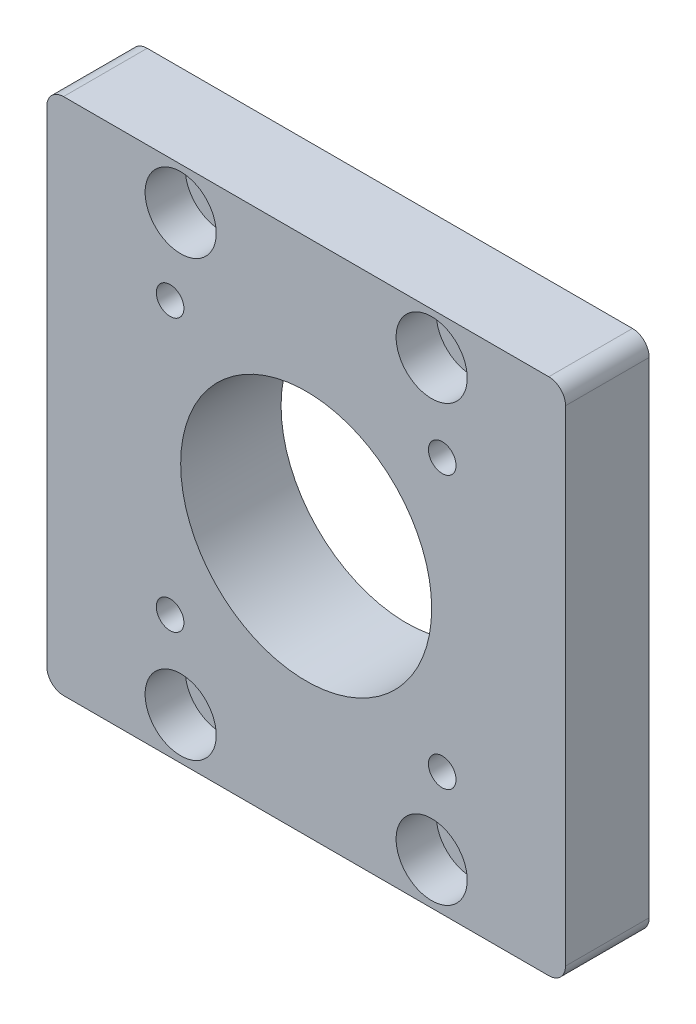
ISO-10303-21;
HEADER;
FILE_DESCRIPTION(('STEP AP214'),'2;1');
FILE_NAME('part.step','',(''),(''),'','','');
FILE_SCHEMA(('AUTOMOTIVE_DESIGN { 1 0 10303 214 1 1 1 1 }'));
ENDSEC;
DATA;
#1=APPLICATION_CONTEXT('core data for automotive mechanical design processes');
#2=APPLICATION_PROTOCOL_DEFINITION('international standard','automotive_design',2000,#1);
#3=PRODUCT_CONTEXT('',#1,'mechanical');
#4=PRODUCT('Part','Part','',(#3));
#5=PRODUCT_RELATED_PRODUCT_CATEGORY('part','',(#4));
#6=PRODUCT_DEFINITION_FORMATION('','',#4);
#7=PRODUCT_DEFINITION_CONTEXT('part definition',#1,'design');
#8=PRODUCT_DEFINITION('design','',#6,#7);
#9=PRODUCT_DEFINITION_SHAPE('','',#8);
#10=(LENGTH_UNIT() NAMED_UNIT(*) SI_UNIT(.MILLI.,.METRE.));
#11=(NAMED_UNIT(*) PLANE_ANGLE_UNIT() SI_UNIT($,.RADIAN.));
#12=(NAMED_UNIT(*) SI_UNIT($,.STERADIAN.) SOLID_ANGLE_UNIT());
#13=UNCERTAINTY_MEASURE_WITH_UNIT(LENGTH_MEASURE(1.E-05),#10,'distance_accuracy_value','');
#14=(GEOMETRIC_REPRESENTATION_CONTEXT(3) GLOBAL_UNCERTAINTY_ASSIGNED_CONTEXT((#13)) GLOBAL_UNIT_ASSIGNED_CONTEXT((#10,
#11,#12)) REPRESENTATION_CONTEXT('',''));
#15=CARTESIAN_POINT('',(0.,0.,0.));
#16=DIRECTION('',(0.,0.,1.));
#17=DIRECTION('',(1.,0.,0.));
#18=AXIS2_PLACEMENT_3D('',#15,#16,#17);
#19=CARTESIAN_POINT('',(0.,0.,0.));
#20=DIRECTION('',(0.,0.,-1.));
#21=DIRECTION('',(-1.,0.,0.));
#22=AXIS2_PLACEMENT_3D('',#19,#20,#21);
#23=PLANE('',#22);
#24=DIRECTION('',(0.,-1.,0.));
#25=VECTOR('',#24,1.);
#26=CARTESIAN_POINT('',(-31.,-31.,0.));
#27=LINE('',#26,#25);
#28=CARTESIAN_POINT('',(-31.,29.,0.));
#29=VERTEX_POINT('',#28);
#30=CARTESIAN_POINT('',(-31.,-29.,0.));
#31=VERTEX_POINT('',#30);
#32=EDGE_CURVE('E130',#29,#31,#27,.T.);
#33=ORIENTED_EDGE('',*,*,#32,.F.);
#34=CARTESIAN_POINT('',(-29.,29.,0.));
#35=DIRECTION('',(0.,0.,-1.));
#36=DIRECTION('',(-1.,0.,0.));
#37=AXIS2_PLACEMENT_3D('',#34,#35,#36);
#38=CIRCLE('',#37,2.);
#39=CARTESIAN_POINT('',(-29.,31.,0.));
#40=VERTEX_POINT('',#39);
#41=EDGE_CURVE('E112',#29,#40,#38,.T.);
#42=ORIENTED_EDGE('',*,*,#41,.T.);
#43=DIRECTION('',(-1.,0.,0.));
#44=VECTOR('',#43,1.);
#45=CARTESIAN_POINT('',(-31.,31.,0.));
#46=LINE('',#45,#44);
#47=CARTESIAN_POINT('',(29.,31.,0.));
#48=VERTEX_POINT('',#47);
#49=EDGE_CURVE('E141',#48,#40,#46,.T.);
#50=ORIENTED_EDGE('',*,*,#49,.F.);
#51=CARTESIAN_POINT('',(29.,29.,0.));
#52=DIRECTION('',(0.,0.,-1.));
#53=DIRECTION('',(-1.,0.,0.));
#54=AXIS2_PLACEMENT_3D('',#51,#52,#53);
#55=CIRCLE('',#54,2.);
#56=CARTESIAN_POINT('',(31.,29.,0.));
#57=VERTEX_POINT('',#56);
#58=EDGE_CURVE('E134',#48,#57,#55,.T.);
#59=ORIENTED_EDGE('',*,*,#58,.T.);
#60=DIRECTION('',(0.,1.,0.));
#61=VECTOR('',#60,1.);
#62=CARTESIAN_POINT('',(31.,-31.,0.));
#63=LINE('',#62,#61);
#64=CARTESIAN_POINT('',(31.,-29.,0.));
#65=VERTEX_POINT('',#64);
#66=EDGE_CURVE('E149',#65,#57,#63,.T.);
#67=ORIENTED_EDGE('',*,*,#66,.F.);
#68=CARTESIAN_POINT('',(29.,-29.,0.));
#69=DIRECTION('',(0.,0.,-1.));
#70=DIRECTION('',(-1.,0.,0.));
#71=AXIS2_PLACEMENT_3D('',#68,#69,#70);
#72=CIRCLE('',#71,2.);
#73=CARTESIAN_POINT('',(29.,-31.,0.));
#74=VERTEX_POINT('',#73);
#75=EDGE_CURVE('E182',#65,#74,#72,.T.);
#76=ORIENTED_EDGE('',*,*,#75,.T.);
#77=DIRECTION('',(1.,0.,0.));
#78=VECTOR('',#77,1.);
#79=CARTESIAN_POINT('',(-31.,-31.,0.));
#80=LINE('',#79,#78);
#81=CARTESIAN_POINT('',(-29.,-31.,0.));
#82=VERTEX_POINT('',#81);
#83=EDGE_CURVE('E140',#82,#74,#80,.T.);
#84=ORIENTED_EDGE('',*,*,#83,.F.);
#85=CARTESIAN_POINT('',(-29.,-29.,0.));
#86=DIRECTION('',(0.,0.,-1.));
#87=DIRECTION('',(-1.,0.,0.));
#88=AXIS2_PLACEMENT_3D('',#85,#86,#87);
#89=CIRCLE('',#88,2.);
#90=EDGE_CURVE('E124',#82,#31,#89,.T.);
#91=ORIENTED_EDGE('',*,*,#90,.T.);
#92=EDGE_LOOP('',(#33,#42,#50,#59,#67,#76,#84,#91));
#93=FACE_BOUND('',#92,.T.);
#94=CARTESIAN_POINT('',(-15.,25.9807621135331,0.));
#95=DIRECTION('',(0.,0.,1.));
#96=DIRECTION('',(1.,0.,0.));
#97=AXIS2_PLACEMENT_3D('',#94,#95,#96);
#98=CIRCLE('',#97,2.25);
#99=CARTESIAN_POINT('',(-12.75,25.9807621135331,0.));
#100=VERTEX_POINT('',#99);
#101=EDGE_CURVE('E290',#100,#100,#98,.T.);
#102=ORIENTED_EDGE('',*,*,#101,.T.);
#103=EDGE_LOOP('',(#102));
#104=FACE_BOUND('',#103,.T.);
#105=CARTESIAN_POINT('',(15.,25.9807621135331,0.));
#106=DIRECTION('',(0.,0.,1.));
#107=DIRECTION('',(1.,0.,0.));
#108=AXIS2_PLACEMENT_3D('',#105,#106,#107);
#109=CIRCLE('',#108,2.25);
#110=CARTESIAN_POINT('',(17.25,25.9807621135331,0.));
#111=VERTEX_POINT('',#110);
#112=EDGE_CURVE('E286',#111,#111,#109,.T.);
#113=ORIENTED_EDGE('',*,*,#112,.T.);
#114=EDGE_LOOP('',(#113));
#115=FACE_BOUND('',#114,.T.);
#116=CARTESIAN_POINT('',(15.,-25.9807621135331,0.));
#117=DIRECTION('',(0.,0.,1.));
#118=DIRECTION('',(1.,0.,0.));
#119=AXIS2_PLACEMENT_3D('',#116,#117,#118);
#120=CIRCLE('',#119,2.25);
#121=CARTESIAN_POINT('',(17.25,-25.9807621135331,0.));
#122=VERTEX_POINT('',#121);
#123=EDGE_CURVE('E282',#122,#122,#120,.T.);
#124=ORIENTED_EDGE('',*,*,#123,.T.);
#125=EDGE_LOOP('',(#124));
#126=FACE_BOUND('',#125,.T.);
#127=CARTESIAN_POINT('',(-15.,-25.9807621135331,0.));
#128=DIRECTION('',(0.,0.,1.));
#129=DIRECTION('',(1.,0.,0.));
#130=AXIS2_PLACEMENT_3D('',#127,#128,#129);
#131=CIRCLE('',#130,2.25);
#132=CARTESIAN_POINT('',(-12.75,-25.9807621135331,0.));
#133=VERTEX_POINT('',#132);
#134=EDGE_CURVE('E157',#133,#133,#131,.T.);
#135=ORIENTED_EDGE('',*,*,#134,.T.);
#136=EDGE_LOOP('',(#135));
#137=FACE_BOUND('',#136,.T.);
#138=CARTESIAN_POINT('',(0.,0.,0.));
#139=DIRECTION('',(0.,0.,-1.));
#140=DIRECTION('',(-1.,0.,0.));
#141=AXIS2_PLACEMENT_3D('',#138,#139,#140);
#142=CIRCLE('',#141,25.);
#143=CARTESIAN_POINT('',(-25.,0.,0.));
#144=VERTEX_POINT('',#143);
#145=EDGE_CURVE('E248',#144,#144,#142,.T.);
#146=ORIENTED_EDGE('',*,*,#145,.F.);
#147=EDGE_LOOP('',(#146));
#148=FACE_BOUND('',#147,.T.);
#149=ADVANCED_FACE('F42',(#93,#104,#115,#126,#137,#148),#23,.T.);
#150=CARTESIAN_POINT('',(-15.,-25.9807621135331,0.));
#151=DIRECTION('',(0.,0.,1.));
#152=DIRECTION('',(1.,0.,0.));
#153=AXIS2_PLACEMENT_3D('',#150,#151,#152);
#154=CYLINDRICAL_SURFACE('',#153,2.25);
#155=ORIENTED_EDGE('',*,*,#134,.F.);
#156=EDGE_LOOP('',(#155));
#157=FACE_BOUND('',#156,.T.);
#158=CARTESIAN_POINT('',(-15.,-25.9807621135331,5.2));
#159=DIRECTION('',(0.,0.,1.));
#160=DIRECTION('',(1.,0.,0.));
#161=AXIS2_PLACEMENT_3D('',#158,#159,#160);
#162=CIRCLE('',#161,2.25);
#163=CARTESIAN_POINT('',(-12.75,-25.9807621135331,5.2));
#164=VERTEX_POINT('',#163);
#165=EDGE_CURVE('E171',#164,#164,#162,.F.);
#166=ORIENTED_EDGE('',*,*,#165,.F.);
#167=EDGE_LOOP('',(#166));
#168=FACE_BOUND('',#167,.T.);
#169=ADVANCED_FACE('F350',(#157,#168),#154,.F.);
#170=CARTESIAN_POINT('',(15.,-25.9807621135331,0.));
#171=DIRECTION('',(0.,0.,1.));
#172=DIRECTION('',(1.,0.,0.));
#173=AXIS2_PLACEMENT_3D('',#170,#171,#172);
#174=CYLINDRICAL_SURFACE('',#173,2.25);
#175=ORIENTED_EDGE('',*,*,#123,.F.);
#176=EDGE_LOOP('',(#175));
#177=FACE_BOUND('',#176,.T.);
#178=CARTESIAN_POINT('',(15.,-25.9807621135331,5.2));
#179=DIRECTION('',(0.,0.,1.));
#180=DIRECTION('',(1.,0.,0.));
#181=AXIS2_PLACEMENT_3D('',#178,#179,#180);
#182=CIRCLE('',#181,2.25);
#183=CARTESIAN_POINT('',(17.25,-25.9807621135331,5.2));
#184=VERTEX_POINT('',#183);
#185=EDGE_CURVE('E165',#184,#184,#182,.F.);
#186=ORIENTED_EDGE('',*,*,#185,.F.);
#187=EDGE_LOOP('',(#186));
#188=FACE_BOUND('',#187,.T.);
#189=ADVANCED_FACE('F355',(#177,#188),#174,.F.);
#190=CARTESIAN_POINT('',(15.,25.9807621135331,0.));
#191=DIRECTION('',(0.,0.,1.));
#192=DIRECTION('',(1.,0.,0.));
#193=AXIS2_PLACEMENT_3D('',#190,#191,#192);
#194=CYLINDRICAL_SURFACE('',#193,2.25);
#195=ORIENTED_EDGE('',*,*,#112,.F.);
#196=EDGE_LOOP('',(#195));
#197=FACE_BOUND('',#196,.T.);
#198=CARTESIAN_POINT('',(15.,25.9807621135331,5.2));
#199=DIRECTION('',(0.,0.,1.));
#200=DIRECTION('',(1.,0.,0.));
#201=AXIS2_PLACEMENT_3D('',#198,#199,#200);
#202=CIRCLE('',#201,2.25);
#203=CARTESIAN_POINT('',(17.25,25.9807621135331,5.2));
#204=VERTEX_POINT('',#203);
#205=EDGE_CURVE('E159',#204,#204,#202,.F.);
#206=ORIENTED_EDGE('',*,*,#205,.F.);
#207=EDGE_LOOP('',(#206));
#208=FACE_BOUND('',#207,.T.);
#209=ADVANCED_FACE('F424',(#197,#208),#194,.F.);
#210=CARTESIAN_POINT('',(-15.,25.9807621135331,0.));
#211=DIRECTION('',(0.,0.,1.));
#212=DIRECTION('',(1.,0.,0.));
#213=AXIS2_PLACEMENT_3D('',#210,#211,#212);
#214=CYLINDRICAL_SURFACE('',#213,2.25);
#215=ORIENTED_EDGE('',*,*,#101,.F.);
#216=EDGE_LOOP('',(#215));
#217=FACE_BOUND('',#216,.T.);
#218=CARTESIAN_POINT('',(-15.,25.9807621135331,5.2));
#219=DIRECTION('',(0.,0.,1.));
#220=DIRECTION('',(1.,0.,0.));
#221=AXIS2_PLACEMENT_3D('',#218,#219,#220);
#222=CIRCLE('',#221,2.25);
#223=CARTESIAN_POINT('',(-12.75,25.9807621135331,5.2));
#224=VERTEX_POINT('',#223);
#225=EDGE_CURVE('E153',#224,#224,#222,.F.);
#226=ORIENTED_EDGE('',*,*,#225,.F.);
#227=EDGE_LOOP('',(#226));
#228=FACE_BOUND('',#227,.T.);
#229=ADVANCED_FACE('F428',(#217,#228),#214,.F.);
#230=CARTESIAN_POINT('',(0.,0.,10.));
#231=DIRECTION('',(0.,0.,-1.));
#232=DIRECTION('',(-1.,0.,0.));
#233=AXIS2_PLACEMENT_3D('',#230,#231,#232);
#234=PLANE('',#233);
#235=CARTESIAN_POINT('',(-15.,-25.9807621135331,10.));
#236=DIRECTION('',(0.,0.,1.));
#237=DIRECTION('',(1.,0.,0.));
#238=AXIS2_PLACEMENT_3D('',#235,#236,#237);
#239=CIRCLE('',#238,4.25);
#240=CARTESIAN_POINT('',(-10.75,-25.9807621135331,10.));
#241=VERTEX_POINT('',#240);
#242=EDGE_CURVE('E254',#241,#241,#239,.T.);
#243=ORIENTED_EDGE('',*,*,#242,.F.);
#244=EDGE_LOOP('',(#243));
#245=FACE_BOUND('',#244,.T.);
#246=CARTESIAN_POINT('',(15.,-25.9807621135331,10.));
#247=DIRECTION('',(0.,0.,1.));
#248=DIRECTION('',(1.,0.,0.));
#249=AXIS2_PLACEMENT_3D('',#246,#247,#248);
#250=CIRCLE('',#249,4.25);
#251=CARTESIAN_POINT('',(19.25,-25.9807621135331,10.));
#252=VERTEX_POINT('',#251);
#253=EDGE_CURVE('E175',#252,#252,#250,.T.);
#254=ORIENTED_EDGE('',*,*,#253,.F.);
#255=EDGE_LOOP('',(#254));
#256=FACE_BOUND('',#255,.T.);
#257=CARTESIAN_POINT('',(15.,25.9807621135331,10.));
#258=DIRECTION('',(0.,0.,1.));
#259=DIRECTION('',(1.,0.,0.));
#260=AXIS2_PLACEMENT_3D('',#257,#258,#259);
#261=CIRCLE('',#260,4.25);
#262=CARTESIAN_POINT('',(19.25,25.9807621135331,10.));
#263=VERTEX_POINT('',#262);
#264=EDGE_CURVE('E169',#263,#263,#261,.T.);
#265=ORIENTED_EDGE('',*,*,#264,.F.);
#266=EDGE_LOOP('',(#265));
#267=FACE_BOUND('',#266,.T.);
#268=CARTESIAN_POINT('',(-15.,25.9807621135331,10.));
#269=DIRECTION('',(0.,0.,1.));
#270=DIRECTION('',(1.,0.,0.));
#271=AXIS2_PLACEMENT_3D('',#268,#269,#270);
#272=CIRCLE('',#271,4.25);
#273=CARTESIAN_POINT('',(-10.75,25.9807621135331,10.));
#274=VERTEX_POINT('',#273);
#275=EDGE_CURVE('E163',#274,#274,#272,.T.);
#276=ORIENTED_EDGE('',*,*,#275,.F.);
#277=EDGE_LOOP('',(#276));
#278=FACE_BOUND('',#277,.T.);
#279=CARTESIAN_POINT('',(-16.2634559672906,-16.2634559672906,10.));
#280=DIRECTION('',(0.,0.,1.));
#281=DIRECTION('',(1.,0.,0.));
#282=AXIS2_PLACEMENT_3D('',#279,#280,#281);
#283=CIRCLE('',#282,1.65);
#284=CARTESIAN_POINT('',(-14.6134559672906,-16.2634559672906,10.));
#285=VERTEX_POINT('',#284);
#286=EDGE_CURVE('E294',#285,#285,#283,.T.);
#287=ORIENTED_EDGE('',*,*,#286,.F.);
#288=EDGE_LOOP('',(#287));
#289=FACE_BOUND('',#288,.T.);
#290=CARTESIAN_POINT('',(16.2634559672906,-16.2634559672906,10.));
#291=DIRECTION('',(0.,0.,1.));
#292=DIRECTION('',(1.,0.,0.));
#293=AXIS2_PLACEMENT_3D('',#290,#291,#292);
#294=CIRCLE('',#293,1.65);
#295=CARTESIAN_POINT('',(17.9134559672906,-16.2634559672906,10.));
#296=VERTEX_POINT('',#295);
#297=EDGE_CURVE('E298',#296,#296,#294,.T.);
#298=ORIENTED_EDGE('',*,*,#297,.F.);
#299=EDGE_LOOP('',(#298));
#300=FACE_BOUND('',#299,.T.);
#301=CARTESIAN_POINT('',(16.2634559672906,16.2634559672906,10.));
#302=DIRECTION('',(0.,0.,1.));
#303=DIRECTION('',(1.,0.,0.));
#304=AXIS2_PLACEMENT_3D('',#301,#302,#303);
#305=CIRCLE('',#304,1.65);
#306=CARTESIAN_POINT('',(17.9134559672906,16.2634559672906,10.));
#307=VERTEX_POINT('',#306);
#308=EDGE_CURVE('E302',#307,#307,#305,.T.);
#309=ORIENTED_EDGE('',*,*,#308,.F.);
#310=EDGE_LOOP('',(#309));
#311=FACE_BOUND('',#310,.T.);
#312=CARTESIAN_POINT('',(-16.2634559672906,16.2634559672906,10.));
#313=DIRECTION('',(0.,0.,1.));
#314=DIRECTION('',(1.,0.,0.));
#315=AXIS2_PLACEMENT_3D('',#312,#313,#314);
#316=CIRCLE('',#315,1.65);
#317=CARTESIAN_POINT('',(-14.6134559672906,16.2634559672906,10.));
#318=VERTEX_POINT('',#317);
#319=EDGE_CURVE('E306',#318,#318,#316,.T.);
#320=ORIENTED_EDGE('',*,*,#319,.F.);
#321=EDGE_LOOP('',(#320));
#322=FACE_BOUND('',#321,.T.);
#323=DIRECTION('',(-1.,0.,0.));
#324=VECTOR('',#323,1.);
#325=CARTESIAN_POINT('',(-31.,31.,10.));
#326=LINE('',#325,#324);
#327=CARTESIAN_POINT('',(29.,31.,10.));
#328=VERTEX_POINT('',#327);
#329=CARTESIAN_POINT('',(-29.,31.,10.));
#330=VERTEX_POINT('',#329);
#331=EDGE_CURVE('E317',#328,#330,#326,.T.);
#332=ORIENTED_EDGE('',*,*,#331,.T.);
#333=CARTESIAN_POINT('',(-29.,29.,10.));
#334=DIRECTION('',(0.,0.,-1.));
#335=DIRECTION('',(-1.,0.,0.));
#336=AXIS2_PLACEMENT_3D('',#333,#334,#335);
#337=CIRCLE('',#336,2.);
#338=CARTESIAN_POINT('',(-31.,29.,10.));
#339=VERTEX_POINT('',#338);
#340=EDGE_CURVE('E199',#330,#339,#337,.F.);
#341=ORIENTED_EDGE('',*,*,#340,.T.);
#342=DIRECTION('',(0.,-1.,0.));
#343=VECTOR('',#342,1.);
#344=CARTESIAN_POINT('',(-31.,-31.,10.));
#345=LINE('',#344,#343);
#346=CARTESIAN_POINT('',(-31.,-29.,10.));
#347=VERTEX_POINT('',#346);
#348=EDGE_CURVE('E132',#339,#347,#345,.T.);
#349=ORIENTED_EDGE('',*,*,#348,.T.);
#350=CARTESIAN_POINT('',(-29.,-29.,10.));
#351=DIRECTION('',(0.,0.,-1.));
#352=DIRECTION('',(-1.,0.,0.));
#353=AXIS2_PLACEMENT_3D('',#350,#351,#352);
#354=CIRCLE('',#353,2.);
#355=CARTESIAN_POINT('',(-29.,-31.,10.));
#356=VERTEX_POINT('',#355);
#357=EDGE_CURVE('E67',#347,#356,#354,.F.);
#358=ORIENTED_EDGE('',*,*,#357,.T.);
#359=DIRECTION('',(1.,0.,0.));
#360=VECTOR('',#359,1.);
#361=CARTESIAN_POINT('',(-31.,-31.,10.));
#362=LINE('',#361,#360);
#363=CARTESIAN_POINT('',(29.,-31.,10.));
#364=VERTEX_POINT('',#363);
#365=EDGE_CURVE('E178',#356,#364,#362,.T.);
#366=ORIENTED_EDGE('',*,*,#365,.T.);
#367=CARTESIAN_POINT('',(29.,-29.,10.));
#368=DIRECTION('',(0.,0.,-1.));
#369=DIRECTION('',(-1.,0.,0.));
#370=AXIS2_PLACEMENT_3D('',#367,#368,#369);
#371=CIRCLE('',#370,2.);
#372=CARTESIAN_POINT('',(31.,-29.,10.));
#373=VERTEX_POINT('',#372);
#374=EDGE_CURVE('E194',#364,#373,#371,.F.);
#375=ORIENTED_EDGE('',*,*,#374,.T.);
#376=DIRECTION('',(0.,1.,0.));
#377=VECTOR('',#376,1.);
#378=CARTESIAN_POINT('',(31.,-31.,10.));
#379=LINE('',#378,#377);
#380=CARTESIAN_POINT('',(31.,29.,10.));
#381=VERTEX_POINT('',#380);
#382=EDGE_CURVE('E146',#373,#381,#379,.T.);
#383=ORIENTED_EDGE('',*,*,#382,.T.);
#384=CARTESIAN_POINT('',(29.,29.,10.));
#385=DIRECTION('',(0.,0.,-1.));
#386=DIRECTION('',(-1.,0.,0.));
#387=AXIS2_PLACEMENT_3D('',#384,#385,#386);
#388=CIRCLE('',#387,2.);
#389=EDGE_CURVE('E191',#381,#328,#388,.F.);
#390=ORIENTED_EDGE('',*,*,#389,.T.);
#391=EDGE_LOOP('',(#332,#341,#349,#358,#366,#375,#383,#390));
#392=FACE_BOUND('',#391,.T.);
#393=CARTESIAN_POINT('',(0.,0.,10.));
#394=DIRECTION('',(0.,0.,1.));
#395=DIRECTION('',(1.,0.,0.));
#396=AXIS2_PLACEMENT_3D('',#393,#394,#395);
#397=CIRCLE('',#396,15.);
#398=CARTESIAN_POINT('',(15.,0.,10.));
#399=VERTEX_POINT('',#398);
#400=EDGE_CURVE('E310',#399,#399,#397,.T.);
#401=ORIENTED_EDGE('',*,*,#400,.F.);
#402=EDGE_LOOP('',(#401));
#403=FACE_BOUND('',#402,.T.);
#404=ADVANCED_FACE('F336',(#245,#256,#267,#278,#289,#300,#311,#322,#392,#403),#234,.F.);
#405=CARTESIAN_POINT('',(31.,-31.,10.));
#406=DIRECTION('',(-1.,0.,0.));
#407=DIRECTION('',(0.,0.,1.));
#408=AXIS2_PLACEMENT_3D('',#405,#406,#407);
#409=PLANE('',#408);
#410=ORIENTED_EDGE('',*,*,#382,.F.);
#411=DIRECTION('',(0.,0.,-1.));
#412=VECTOR('',#411,1.);
#413=CARTESIAN_POINT('',(31.,-29.,10.));
#414=LINE('',#413,#412);
#415=EDGE_CURVE('E11',#373,#65,#414,.T.);
#416=ORIENTED_EDGE('',*,*,#415,.T.);
#417=ORIENTED_EDGE('',*,*,#66,.T.);
#418=DIRECTION('',(0.,0.,-1.));
#419=VECTOR('',#418,1.);
#420=CARTESIAN_POINT('',(31.,29.,10.));
#421=LINE('',#420,#419);
#422=EDGE_CURVE('E52',#57,#381,#421,.F.);
#423=ORIENTED_EDGE('',*,*,#422,.T.);
#424=EDGE_LOOP('',(#410,#416,#417,#423));
#425=FACE_BOUND('',#424,.T.);
#426=ADVANCED_FACE('F330',(#425),#409,.F.);
#427=CARTESIAN_POINT('',(-31.,31.,10.));
#428=DIRECTION('',(0.,-1.,0.));
#429=DIRECTION('',(0.,0.,-1.));
#430=AXIS2_PLACEMENT_3D('',#427,#428,#429);
#431=PLANE('',#430);
#432=ORIENTED_EDGE('',*,*,#49,.T.);
#433=DIRECTION('',(0.,0.,-1.));
#434=VECTOR('',#433,1.);
#435=CARTESIAN_POINT('',(-29.,31.,10.));
#436=LINE('',#435,#434);
#437=EDGE_CURVE('E117',#40,#330,#436,.F.);
#438=ORIENTED_EDGE('',*,*,#437,.T.);
#439=ORIENTED_EDGE('',*,*,#331,.F.);
#440=DIRECTION('',(0.,0.,-1.));
#441=VECTOR('',#440,1.);
#442=CARTESIAN_POINT('',(29.,31.,10.));
#443=LINE('',#442,#441);
#444=EDGE_CURVE('E123',#328,#48,#443,.T.);
#445=ORIENTED_EDGE('',*,*,#444,.T.);
#446=EDGE_LOOP('',(#432,#438,#439,#445));
#447=FACE_BOUND('',#446,.T.);
#448=ADVANCED_FACE('F339',(#447),#431,.F.);
#449=CARTESIAN_POINT('',(-31.,-31.,10.));
#450=DIRECTION('',(1.,0.,0.));
#451=DIRECTION('',(0.,0.,-1.));
#452=AXIS2_PLACEMENT_3D('',#449,#450,#451);
#453=PLANE('',#452);
#454=ORIENTED_EDGE('',*,*,#348,.F.);
#455=DIRECTION('',(0.,0.,-1.));
#456=VECTOR('',#455,1.);
#457=CARTESIAN_POINT('',(-31.,29.,10.));
#458=LINE('',#457,#456);
#459=EDGE_CURVE('E116',#339,#29,#458,.T.);
#460=ORIENTED_EDGE('',*,*,#459,.T.);
#461=ORIENTED_EDGE('',*,*,#32,.T.);
#462=DIRECTION('',(0.,0.,-1.));
#463=VECTOR('',#462,1.);
#464=CARTESIAN_POINT('',(-31.,-29.,10.));
#465=LINE('',#464,#463);
#466=EDGE_CURVE('E135',#31,#347,#465,.F.);
#467=ORIENTED_EDGE('',*,*,#466,.T.);
#468=EDGE_LOOP('',(#454,#460,#461,#467));
#469=FACE_BOUND('',#468,.T.);
#470=ADVANCED_FACE('F129',(#469),#453,.F.);
#471=CARTESIAN_POINT('',(-31.,-31.,10.));
#472=DIRECTION('',(0.,1.,0.));
#473=DIRECTION('',(0.,0.,1.));
#474=AXIS2_PLACEMENT_3D('',#471,#472,#473);
#475=PLANE('',#474);
#476=ORIENTED_EDGE('',*,*,#365,.F.);
#477=DIRECTION('',(0.,0.,-1.));
#478=VECTOR('',#477,1.);
#479=CARTESIAN_POINT('',(-29.,-31.,10.));
#480=LINE('',#479,#478);
#481=EDGE_CURVE('E204',#356,#82,#480,.T.);
#482=ORIENTED_EDGE('',*,*,#481,.T.);
#483=ORIENTED_EDGE('',*,*,#83,.T.);
#484=DIRECTION('',(0.,0.,-1.));
#485=VECTOR('',#484,1.);
#486=CARTESIAN_POINT('',(29.,-31.,10.));
#487=LINE('',#486,#485);
#488=EDGE_CURVE('E60',#74,#364,#487,.F.);
#489=ORIENTED_EDGE('',*,*,#488,.T.);
#490=EDGE_LOOP('',(#476,#482,#483,#489));
#491=FACE_BOUND('',#490,.T.);
#492=ADVANCED_FACE('F346',(#491),#475,.F.);
#493=CARTESIAN_POINT('',(0.,0.,10.));
#494=DIRECTION('',(0.,0.,-1.));
#495=DIRECTION('',(-1.,0.,0.));
#496=AXIS2_PLACEMENT_3D('',#493,#494,#495);
#497=CYLINDRICAL_SURFACE('',#496,15.);
#498=ORIENTED_EDGE('',*,*,#400,.T.);
#499=EDGE_LOOP('',(#498));
#500=FACE_BOUND('',#499,.T.);
#501=CARTESIAN_POINT('',(0.,0.,-2.));
#502=DIRECTION('',(0.,0.,-1.));
#503=DIRECTION('',(-1.,0.,0.));
#504=AXIS2_PLACEMENT_3D('',#501,#502,#503);
#505=CIRCLE('',#504,15.);
#506=CARTESIAN_POINT('',(-15.,0.,-2.));
#507=VERTEX_POINT('',#506);
#508=EDGE_CURVE('E214',#507,#507,#505,.T.);
#509=ORIENTED_EDGE('',*,*,#508,.T.);
#510=EDGE_LOOP('',(#509));
#511=FACE_BOUND('',#510,.T.);
#512=ADVANCED_FACE('F362',(#500,#511),#497,.F.);
#513=CARTESIAN_POINT('',(-16.2634559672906,16.2634559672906,0.));
#514=DIRECTION('',(0.,0.,1.));
#515=DIRECTION('',(1.,0.,0.));
#516=AXIS2_PLACEMENT_3D('',#513,#514,#515);
#517=CYLINDRICAL_SURFACE('',#516,1.65);
#518=ORIENTED_EDGE('',*,*,#319,.T.);
#519=EDGE_LOOP('',(#518));
#520=FACE_BOUND('',#519,.T.);
#521=CARTESIAN_POINT('',(-16.2634559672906,16.2634559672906,-2.));
#522=DIRECTION('',(0.,0.,-1.));
#523=DIRECTION('',(-1.,0.,0.));
#524=AXIS2_PLACEMENT_3D('',#521,#522,#523);
#525=CIRCLE('',#524,1.64999999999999);
#526=CARTESIAN_POINT('',(-17.9134559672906,16.2634559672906,-2.));
#527=VERTEX_POINT('',#526);
#528=EDGE_CURVE('E210',#527,#527,#525,.T.);
#529=ORIENTED_EDGE('',*,*,#528,.T.);
#530=EDGE_LOOP('',(#529));
#531=FACE_BOUND('',#530,.T.);
#532=ADVANCED_FACE('F366',(#520,#531),#517,.F.);
#533=CARTESIAN_POINT('',(16.2634559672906,16.2634559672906,0.));
#534=DIRECTION('',(0.,0.,1.));
#535=DIRECTION('',(1.,0.,0.));
#536=AXIS2_PLACEMENT_3D('',#533,#534,#535);
#537=CYLINDRICAL_SURFACE('',#536,1.65);
#538=ORIENTED_EDGE('',*,*,#308,.T.);
#539=EDGE_LOOP('',(#538));
#540=FACE_BOUND('',#539,.T.);
#541=CARTESIAN_POINT('',(16.2634559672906,16.2634559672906,-2.));
#542=DIRECTION('',(0.,0.,-1.));
#543=DIRECTION('',(-1.,0.,0.));
#544=AXIS2_PLACEMENT_3D('',#541,#542,#543);
#545=CIRCLE('',#544,1.64999999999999);
#546=CARTESIAN_POINT('',(14.6134559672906,16.2634559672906,-2.));
#547=VERTEX_POINT('',#546);
#548=EDGE_CURVE('E46',#547,#547,#545,.T.);
#549=ORIENTED_EDGE('',*,*,#548,.T.);
#550=EDGE_LOOP('',(#549));
#551=FACE_BOUND('',#550,.T.);
#552=ADVANCED_FACE('F229',(#540,#551),#537,.F.);
#553=CARTESIAN_POINT('',(16.2634559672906,-16.2634559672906,0.));
#554=DIRECTION('',(0.,0.,1.));
#555=DIRECTION('',(1.,0.,0.));
#556=AXIS2_PLACEMENT_3D('',#553,#554,#555);
#557=CYLINDRICAL_SURFACE('',#556,1.65);
#558=ORIENTED_EDGE('',*,*,#297,.T.);
#559=EDGE_LOOP('',(#558));
#560=FACE_BOUND('',#559,.T.);
#561=CARTESIAN_POINT('',(16.2634559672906,-16.2634559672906,-2.));
#562=DIRECTION('',(0.,0.,-1.));
#563=DIRECTION('',(-1.,0.,0.));
#564=AXIS2_PLACEMENT_3D('',#561,#562,#563);
#565=CIRCLE('',#564,1.64999999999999);
#566=CARTESIAN_POINT('',(14.6134559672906,-16.2634559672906,-2.));
#567=VERTEX_POINT('',#566);
#568=EDGE_CURVE('E218',#567,#567,#565,.T.);
#569=ORIENTED_EDGE('',*,*,#568,.T.);
#570=EDGE_LOOP('',(#569));
#571=FACE_BOUND('',#570,.T.);
#572=ADVANCED_FACE('F435',(#560,#571),#557,.F.);
#573=CARTESIAN_POINT('',(-16.2634559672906,-16.2634559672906,0.));
#574=DIRECTION('',(0.,0.,1.));
#575=DIRECTION('',(1.,0.,0.));
#576=AXIS2_PLACEMENT_3D('',#573,#574,#575);
#577=CYLINDRICAL_SURFACE('',#576,1.65);
#578=ORIENTED_EDGE('',*,*,#286,.T.);
#579=EDGE_LOOP('',(#578));
#580=FACE_BOUND('',#579,.T.);
#581=CARTESIAN_POINT('',(-16.2634559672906,-16.2634559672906,-2.));
#582=DIRECTION('',(0.,0.,-1.));
#583=DIRECTION('',(-1.,0.,0.));
#584=AXIS2_PLACEMENT_3D('',#581,#582,#583);
#585=CIRCLE('',#584,1.64999999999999);
#586=CARTESIAN_POINT('',(-17.9134559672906,-16.2634559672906,-2.));
#587=VERTEX_POINT('',#586);
#588=EDGE_CURVE('E215',#587,#587,#585,.T.);
#589=ORIENTED_EDGE('',*,*,#588,.T.);
#590=EDGE_LOOP('',(#589));
#591=FACE_BOUND('',#590,.T.);
#592=ADVANCED_FACE('F417',(#580,#591),#577,.F.);
#593=CARTESIAN_POINT('',(-15.,25.9807621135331,5.2));
#594=DIRECTION('',(0.,0.,1.));
#595=DIRECTION('',(1.,0.,0.));
#596=AXIS2_PLACEMENT_3D('',#593,#594,#595);
#597=PLANE('',#596);
#598=CARTESIAN_POINT('',(-15.,25.9807621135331,5.2));
#599=DIRECTION('',(0.,0.,1.));
#600=DIRECTION('',(1.,0.,0.));
#601=AXIS2_PLACEMENT_3D('',#598,#599,#600);
#602=CIRCLE('',#601,4.25);
#603=CARTESIAN_POINT('',(-10.75,25.9807621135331,5.2));
#604=VERTEX_POINT('',#603);
#605=EDGE_CURVE('E158',#604,#604,#602,.T.);
#606=ORIENTED_EDGE('',*,*,#605,.T.);
#607=EDGE_LOOP('',(#606));
#608=FACE_BOUND('',#607,.T.);
#609=ORIENTED_EDGE('',*,*,#225,.T.);
#610=EDGE_LOOP('',(#609));
#611=FACE_BOUND('',#610,.T.);
#612=ADVANCED_FACE('F414',(#608,#611),#597,.T.);
#613=CARTESIAN_POINT('',(-15.,25.9807621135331,5.2));
#614=DIRECTION('',(0.,0.,1.));
#615=DIRECTION('',(1.,0.,0.));
#616=AXIS2_PLACEMENT_3D('',#613,#614,#615);
#617=CYLINDRICAL_SURFACE('',#616,4.25);
#618=ORIENTED_EDGE('',*,*,#605,.F.);
#619=EDGE_LOOP('',(#618));
#620=FACE_BOUND('',#619,.T.);
#621=ORIENTED_EDGE('',*,*,#275,.T.);
#622=EDGE_LOOP('',(#621));
#623=FACE_BOUND('',#622,.T.);
#624=ADVANCED_FACE('F409',(#620,#623),#617,.F.);
#625=CARTESIAN_POINT('',(15.,25.9807621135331,5.2));
#626=DIRECTION('',(0.,0.,1.));
#627=DIRECTION('',(1.,0.,0.));
#628=AXIS2_PLACEMENT_3D('',#625,#626,#627);
#629=PLANE('',#628);
#630=CARTESIAN_POINT('',(15.,25.9807621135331,5.2));
#631=DIRECTION('',(0.,0.,1.));
#632=DIRECTION('',(1.,0.,0.));
#633=AXIS2_PLACEMENT_3D('',#630,#631,#632);
#634=CIRCLE('',#633,4.25);
#635=CARTESIAN_POINT('',(19.25,25.9807621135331,5.2));
#636=VERTEX_POINT('',#635);
#637=EDGE_CURVE('E164',#636,#636,#634,.T.);
#638=ORIENTED_EDGE('',*,*,#637,.T.);
#639=EDGE_LOOP('',(#638));
#640=FACE_BOUND('',#639,.T.);
#641=ORIENTED_EDGE('',*,*,#205,.T.);
#642=EDGE_LOOP('',(#641));
#643=FACE_BOUND('',#642,.T.);
#644=ADVANCED_FACE('F406',(#640,#643),#629,.T.);
#645=CARTESIAN_POINT('',(15.,25.9807621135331,5.2));
#646=DIRECTION('',(0.,0.,1.));
#647=DIRECTION('',(1.,0.,0.));
#648=AXIS2_PLACEMENT_3D('',#645,#646,#647);
#649=CYLINDRICAL_SURFACE('',#648,4.25);
#650=ORIENTED_EDGE('',*,*,#637,.F.);
#651=EDGE_LOOP('',(#650));
#652=FACE_BOUND('',#651,.T.);
#653=ORIENTED_EDGE('',*,*,#264,.T.);
#654=EDGE_LOOP('',(#653));
#655=FACE_BOUND('',#654,.T.);
#656=ADVANCED_FACE('F401',(#652,#655),#649,.F.);
#657=CARTESIAN_POINT('',(15.,-25.9807621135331,5.2));
#658=DIRECTION('',(0.,0.,1.));
#659=DIRECTION('',(1.,0.,0.));
#660=AXIS2_PLACEMENT_3D('',#657,#658,#659);
#661=PLANE('',#660);
#662=CARTESIAN_POINT('',(15.,-25.9807621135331,5.2));
#663=DIRECTION('',(0.,0.,1.));
#664=DIRECTION('',(1.,0.,0.));
#665=AXIS2_PLACEMENT_3D('',#662,#663,#664);
#666=CIRCLE('',#665,4.25);
#667=CARTESIAN_POINT('',(19.25,-25.9807621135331,5.2));
#668=VERTEX_POINT('',#667);
#669=EDGE_CURVE('E170',#668,#668,#666,.T.);
#670=ORIENTED_EDGE('',*,*,#669,.T.);
#671=EDGE_LOOP('',(#670));
#672=FACE_BOUND('',#671,.T.);
#673=ORIENTED_EDGE('',*,*,#185,.T.);
#674=EDGE_LOOP('',(#673));
#675=FACE_BOUND('',#674,.T.);
#676=ADVANCED_FACE('F398',(#672,#675),#661,.T.);
#677=CARTESIAN_POINT('',(15.,-25.9807621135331,5.2));
#678=DIRECTION('',(0.,0.,1.));
#679=DIRECTION('',(1.,0.,0.));
#680=AXIS2_PLACEMENT_3D('',#677,#678,#679);
#681=CYLINDRICAL_SURFACE('',#680,4.25);
#682=ORIENTED_EDGE('',*,*,#669,.F.);
#683=EDGE_LOOP('',(#682));
#684=FACE_BOUND('',#683,.T.);
#685=ORIENTED_EDGE('',*,*,#253,.T.);
#686=EDGE_LOOP('',(#685));
#687=FACE_BOUND('',#686,.T.);
#688=ADVANCED_FACE('F391',(#684,#687),#681,.F.);
#689=CARTESIAN_POINT('',(-15.,-25.9807621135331,5.2));
#690=DIRECTION('',(0.,0.,1.));
#691=DIRECTION('',(1.,0.,0.));
#692=AXIS2_PLACEMENT_3D('',#689,#690,#691);
#693=PLANE('',#692);
#694=CARTESIAN_POINT('',(-15.,-25.9807621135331,5.2));
#695=DIRECTION('',(0.,0.,1.));
#696=DIRECTION('',(1.,0.,0.));
#697=AXIS2_PLACEMENT_3D('',#694,#695,#696);
#698=CIRCLE('',#697,4.25);
#699=CARTESIAN_POINT('',(-10.75,-25.9807621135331,5.2));
#700=VERTEX_POINT('',#699);
#701=EDGE_CURVE('E176',#700,#700,#698,.T.);
#702=ORIENTED_EDGE('',*,*,#701,.T.);
#703=EDGE_LOOP('',(#702));
#704=FACE_BOUND('',#703,.T.);
#705=ORIENTED_EDGE('',*,*,#165,.T.);
#706=EDGE_LOOP('',(#705));
#707=FACE_BOUND('',#706,.T.);
#708=ADVANCED_FACE('F385',(#704,#707),#693,.T.);
#709=CARTESIAN_POINT('',(-15.,-25.9807621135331,5.2));
#710=DIRECTION('',(0.,0.,1.));
#711=DIRECTION('',(1.,0.,0.));
#712=AXIS2_PLACEMENT_3D('',#709,#710,#711);
#713=CYLINDRICAL_SURFACE('',#712,4.25);
#714=ORIENTED_EDGE('',*,*,#701,.F.);
#715=EDGE_LOOP('',(#714));
#716=FACE_BOUND('',#715,.T.);
#717=ORIENTED_EDGE('',*,*,#242,.T.);
#718=EDGE_LOOP('',(#717));
#719=FACE_BOUND('',#718,.T.);
#720=ADVANCED_FACE('F380',(#716,#719),#713,.F.);
#721=CARTESIAN_POINT('',(-29.,29.,10.));
#722=DIRECTION('',(0.,0.,-1.));
#723=DIRECTION('',(-1.,0.,0.));
#724=AXIS2_PLACEMENT_3D('',#721,#722,#723);
#725=CYLINDRICAL_SURFACE('',#724,2.);
#726=ORIENTED_EDGE('',*,*,#340,.F.);
#727=ORIENTED_EDGE('',*,*,#437,.F.);
#728=ORIENTED_EDGE('',*,*,#41,.F.);
#729=ORIENTED_EDGE('',*,*,#459,.F.);
#730=EDGE_LOOP('',(#726,#727,#728,#729));
#731=FACE_BOUND('',#730,.T.);
#732=ADVANCED_FACE('F115',(#731),#725,.T.);
#733=CARTESIAN_POINT('',(-29.,-29.,10.));
#734=DIRECTION('',(0.,0.,-1.));
#735=DIRECTION('',(-1.,0.,0.));
#736=AXIS2_PLACEMENT_3D('',#733,#734,#735);
#737=CYLINDRICAL_SURFACE('',#736,2.);
#738=ORIENTED_EDGE('',*,*,#357,.F.);
#739=ORIENTED_EDGE('',*,*,#466,.F.);
#740=ORIENTED_EDGE('',*,*,#90,.F.);
#741=ORIENTED_EDGE('',*,*,#481,.F.);
#742=EDGE_LOOP('',(#738,#739,#740,#741));
#743=FACE_BOUND('',#742,.T.);
#744=ADVANCED_FACE('F371',(#743),#737,.T.);
#745=CARTESIAN_POINT('',(29.,-29.,10.));
#746=DIRECTION('',(0.,0.,-1.));
#747=DIRECTION('',(-1.,0.,0.));
#748=AXIS2_PLACEMENT_3D('',#745,#746,#747);
#749=CYLINDRICAL_SURFACE('',#748,2.);
#750=ORIENTED_EDGE('',*,*,#374,.F.);
#751=ORIENTED_EDGE('',*,*,#488,.F.);
#752=ORIENTED_EDGE('',*,*,#75,.F.);
#753=ORIENTED_EDGE('',*,*,#415,.F.);
#754=EDGE_LOOP('',(#750,#751,#752,#753));
#755=FACE_BOUND('',#754,.T.);
#756=ADVANCED_FACE('F373',(#755),#749,.T.);
#757=CARTESIAN_POINT('',(29.,29.,10.));
#758=DIRECTION('',(0.,0.,-1.));
#759=DIRECTION('',(-1.,0.,0.));
#760=AXIS2_PLACEMENT_3D('',#757,#758,#759);
#761=CYLINDRICAL_SURFACE('',#760,2.);
#762=ORIENTED_EDGE('',*,*,#389,.F.);
#763=ORIENTED_EDGE('',*,*,#422,.F.);
#764=ORIENTED_EDGE('',*,*,#58,.F.);
#765=ORIENTED_EDGE('',*,*,#444,.F.);
#766=EDGE_LOOP('',(#762,#763,#764,#765));
#767=FACE_BOUND('',#766,.T.);
#768=ADVANCED_FACE('F44',(#767),#761,.T.);
#769=CARTESIAN_POINT('',(0.,0.,-2.));
#770=DIRECTION('',(0.,0.,-1.));
#771=DIRECTION('',(-1.,0.,0.));
#772=AXIS2_PLACEMENT_3D('',#769,#770,#771);
#773=PLANE('',#772);
#774=ORIENTED_EDGE('',*,*,#548,.F.);
#775=EDGE_LOOP('',(#774));
#776=FACE_BOUND('',#775,.T.);
#777=ORIENTED_EDGE('',*,*,#568,.F.);
#778=EDGE_LOOP('',(#777));
#779=FACE_BOUND('',#778,.T.);
#780=ORIENTED_EDGE('',*,*,#588,.F.);
#781=EDGE_LOOP('',(#780));
#782=FACE_BOUND('',#781,.T.);
#783=ORIENTED_EDGE('',*,*,#528,.F.);
#784=EDGE_LOOP('',(#783));
#785=FACE_BOUND('',#784,.T.);
#786=CARTESIAN_POINT('',(0.,0.,-2.));
#787=DIRECTION('',(0.,0.,-1.));
#788=DIRECTION('',(-1.,0.,0.));
#789=AXIS2_PLACEMENT_3D('',#786,#787,#788);
#790=CIRCLE('',#789,25.);
#791=CARTESIAN_POINT('',(-25.,0.,-2.));
#792=VERTEX_POINT('',#791);
#793=EDGE_CURVE('E244',#792,#792,#790,.T.);
#794=ORIENTED_EDGE('',*,*,#793,.T.);
#795=EDGE_LOOP('',(#794));
#796=FACE_BOUND('',#795,.T.);
#797=ORIENTED_EDGE('',*,*,#508,.F.);
#798=EDGE_LOOP('',(#797));
#799=FACE_BOUND('',#798,.T.);
#800=ADVANCED_FACE('F231',(#776,#779,#782,#785,#796,#799),#773,.T.);
#801=CARTESIAN_POINT('',(0.,0.,-2.));
#802=DIRECTION('',(0.,0.,1.));
#803=DIRECTION('',(1.,0.,0.));
#804=AXIS2_PLACEMENT_3D('',#801,#802,#803);
#805=CYLINDRICAL_SURFACE('',#804,25.);
#806=ORIENTED_EDGE('',*,*,#793,.F.);
#807=EDGE_LOOP('',(#806));
#808=FACE_BOUND('',#807,.T.);
#809=ORIENTED_EDGE('',*,*,#145,.T.);
#810=EDGE_LOOP('',(#809));
#811=FACE_BOUND('',#810,.T.);
#812=ADVANCED_FACE('F234',(#808,#811),#805,.T.);
#813=CLOSED_SHELL('',(#149,#169,#189,#209,#229,#404,#426,#448,#470,#492,#512,#532,#552,#572,
#592,#612,#624,#644,#656,#676,#688,#708,#720,#732,#744,#756,#768,#800,#812));
#814=MANIFOLD_SOLID_BREP('B2',#813);
#815=ADVANCED_BREP_SHAPE_REPRESENTATION('',(#18,#814),#14);
#816=SHAPE_DEFINITION_REPRESENTATION(#9,#815);
ENDSEC;
END-ISO-10303-21;
